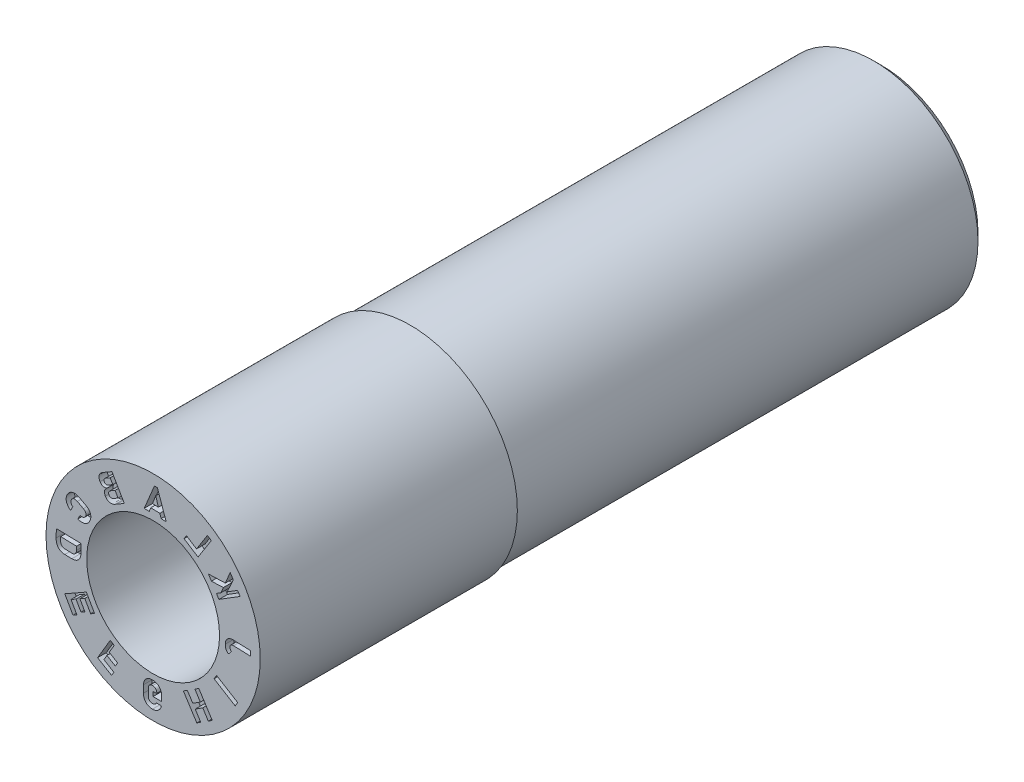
from build123d import *

# Parameters (mm, degrees)
SKETCH4_W          = 11
SKETCH4_H          = 1
CUT_EXTRUDE1_DEPTH = 0.2
CUT_EXTRUDE2_DEPTH = 1.4


with BuildPart() as part:
    # Sketch1 → Revolve1 (revolve)
    with BuildSketch(Plane(origin=(0, 0, 0), x_dir=(0, 0, -1), z_dir=(1, 0, 0)), mode=Mode.PRIVATE) as revolve1_sk:
        Polygon((0, 2.5), (0, 1.55), (2.8, 1.55), (2.8, 0.8), (14, 0.8), (14, 1.5), (17, 1.5), (17, 2.25), (16.75, 2.5), align=None)
    revolve(revolve1_sk.sketch.rotate(Axis((0, 0, 3.797909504), (0, 0, -1)), 90), axis=Axis((0, 0, 3.797909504), (0, 0, -1)))

    # Sketch4 → Cut-Revolve1 (revolve, cut)
    with BuildSketch(Plane(origin=(0, 0, 0), x_dir=(0, 0, -1), z_dir=(1, 0, 0)), mode=Mode.PRIVATE) as cut_revolve1_sk:
        with Locations((11.5, 2.935)):
            Rectangle(SKETCH4_W, SKETCH4_H)
    revolve(cut_revolve1_sk.sketch.rotate(Axis((0, 0, 0), (0, 0, -1)), 90), axis=Axis((0, 0, 0), (0, 0, -1)), mode=Mode.SUBTRACT)

    # Sketch2 → Cut-Extrude1 (cut)
    # profile 1 of 12: a face of its own
    with BuildSketch(Plane.XY):
        Polygon((1.72661267, 0.970958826), (1.870917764, 1.28365961), (1.798222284, 1.400652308), (1.685546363, 1.127555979), (1.291940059, 1.114724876), (1.360540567, 1.004369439), (1.638844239, 1.014362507), (1.584484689, 0.882609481), (1.477586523, 0.816159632), (1.535391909, 0.723134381), (2.028751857, 1.029815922), (1.970946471, 1.122841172), align=None)
    # profile 2 of 12: a face of its own
    with BuildSketch(Plane.XY):
        Polygon((1.158278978, -1.657754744), (1.287748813, -1.860409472), (1.380179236, -1.801341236), (1.067016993, -1.311159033), (0.97458657, -1.370227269), (1.101447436, -1.568798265), (0.925495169, -1.681204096), (0.798646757, -1.482652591), (0.706269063, -1.541615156), (1.019431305, -2.031797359), (1.111808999, -1.972834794), (0.982326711, -1.770160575), align=None)
    # profile 3 of 12: a face of its own
    with BuildSketch(Plane.XY):
        Polygon((1.35845363, 1.824056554), (1.266461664, 1.882404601), (1.01308301, 1.482650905), (0.777887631, 1.631784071), (0.721674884, 1.543017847), (1.048827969, 1.335562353), align=None)
    # profile 4 of 12: a face of its own
    with BuildSketch(Plane.XY):
        Polygon((0.100166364, 2.263137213), (0.030849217, 2.265220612), (-0.207963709, 1.692197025), (-0.090343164, 1.688762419), (-0.055088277, 1.780610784), (0.157240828, 1.774362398), (0.18705009, 1.680539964), (0.304552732, 1.677112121), align=None)
        Polygon((0.059995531, 2.08043474), (0.123465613, 1.880667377), (-0.015117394, 1.884745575), align=None, mode=Mode.SUBTRACT)
    # profile 5 of 12: a face of its own
    with BuildSketch(Plane.XY):
        with BuildLine():
            Line((-2.258824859, 0.258308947), (-2.263441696, 0.066635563))
            add(Edge.make_bspline(
                [(-2.263441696, 0.066635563), (-2.263646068, 0.054963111), (-2.263554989, 0.037720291), (-2.261339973, 0.015282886), (-2.259222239, -0.000629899), (-2.256234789, -0.015881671), (-2.252219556, -0.030426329), (-2.247803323, -0.044416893), (-2.242363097, -0.057683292), (-2.236290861, -0.070305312), (-2.229345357, -0.082120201), (-2.221889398, -0.093304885), (-2.213612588, -0.10367424), (-2.204557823, -0.113253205), (-2.194836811, -0.122111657), (-2.18442689, -0.130251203), (-2.173234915, -0.137521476), (-2.161455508, -0.144123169), (-2.148960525, -0.149863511), (-2.13584036, -0.154657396), (-2.122208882, -0.159015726), (-2.107848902, -0.162054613), (-2.087633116, -0.165517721), (-2.072008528, -0.166722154), (-2.061412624, -0.166919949)],
                knots=[0, 0, 0, 0, 0.099794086, 0.147020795, 0.192531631, 0.236902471, 0.279655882, 0.321378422, 0.362153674, 0.402037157, 0.4409344, 0.479137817, 0.51678508, 0.554126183, 0.59163048, 0.629044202, 0.666880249, 0.705532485, 0.744313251, 0.784196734, 0.824816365, 0.866447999, 0.909454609, 1, 1, 1, 1], degree=3))
            Line((-2.061412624, -0.166919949), (-1.897139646, -0.170910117))
            add(Edge.make_bspline(
                [(-1.897139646, -0.170910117), (-1.887036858, -0.171037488), (-1.872062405, -0.170811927), (-1.852534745, -0.168479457), (-1.838519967, -0.16617852), (-1.825038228, -0.162754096), (-1.811978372, -0.158682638), (-1.799466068, -0.153723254), (-1.787402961, -0.14801727), (-1.775855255, -0.141532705), (-1.764972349, -0.13410769), (-1.754686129, -0.125921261), (-1.745008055, -0.116931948), (-1.735981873, -0.107051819), (-1.72769524, -0.096282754), (-1.719854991, -0.084830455), (-1.71279458, -0.072499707), (-1.706343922, -0.059446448), (-1.700669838, -0.045634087), (-1.696015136, -0.031005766), (-1.691914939, -0.01570972), (-1.688686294, 0.000364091), (-1.685276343, 0.023208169), (-1.684369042, 0.040847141), (-1.683927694, 0.0528024)],
                knots=[0, 0, 0, 0, 0.086499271, 0.127800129, 0.16816221, 0.207901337, 0.246685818, 0.285119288, 0.322935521, 0.36077424, 0.398289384, 0.435513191, 0.473140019, 0.51117007, 0.549849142, 0.589296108, 0.62981103, 0.671288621, 0.713785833, 0.757410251, 0.802522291, 0.849197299, 0.897584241, 1, 1, 1, 1], degree=3))
            Line((-1.683927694, 0.0528024), (-1.679328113, 0.244121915))
            Line((-1.679328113, 0.244121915), (-2.258824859, 0.258308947))
        make_face()
        with BuildLine():
            Line((-1.787242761, 0.137458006), (-1.78929147, 0.052501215))
            add(Edge.make_bspline(
                [(-1.78929147, 0.052501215), (-1.789455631, 0.044018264), (-1.790659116, 0.031686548), (-1.793569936, 0.015835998), (-1.796737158, 0.005081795), (-1.800609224, -0.004924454), (-1.805353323, -0.014117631), (-1.810862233, -0.022538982), (-1.817153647, -0.030150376), (-1.824099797, -0.036964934), (-1.831808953, -0.042768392), (-1.840111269, -0.047729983), (-1.849124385, -0.051690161), (-1.858776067, -0.054594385), (-1.872784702, -0.057552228), (-1.883794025, -0.057984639), (-1.891269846, -0.05780714)],
                knots=[0, 0, 0, 0, 0.148983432, 0.217482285, 0.282935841, 0.345735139, 0.405806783, 0.464430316, 0.522276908, 0.579066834, 0.635058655, 0.691480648, 0.748728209, 0.807608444, 0.868361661, 1, 1, 1, 1], degree=3))
            Line((-1.891269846, -0.05780714), (-2.061918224, -0.053624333))
            add(Edge.make_bspline(
                [(-2.061918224, -0.053624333), (-2.069440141, -0.053626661), (-2.080374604, -0.052265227), (-2.094363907, -0.048992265), (-2.103786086, -0.045384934), (-2.112556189, -0.041052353), (-2.120670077, -0.035782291), (-2.128016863, -0.029486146), (-2.134685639, -0.02238072), (-2.140616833, -0.014508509), (-2.145612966, -0.005766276), (-2.149942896, 0.003627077), (-2.153110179, 0.01385057), (-2.155934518, 0.024669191), (-2.158017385, 0.040654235), (-2.158642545, 0.053039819), (-2.158342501, 0.061510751)],
                knots=[0, 0, 0, 0, 0.131832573, 0.193163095, 0.252020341, 0.308710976, 0.364837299, 0.421574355, 0.478332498, 0.535823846, 0.594354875, 0.655002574, 0.7171934, 0.782202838, 0.851268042, 1, 1, 1, 1], degree=3))
            Line((-2.158342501, 0.061510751), (-2.156293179, 0.146492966))
            Line((-2.156293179, 0.146492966), (-1.787242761, 0.137458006))
        make_face(mode=Mode.SUBTRACT)
    # profile 6 of 12: a face of its own
    with BuildSketch(Plane.XY):
        with BuildLine():
            Line((-1.131150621, 1.959210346), (-1.164860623, 1.939693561))
            add(Edge.make_bspline(
                [(-1.164860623, 1.939693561), (-1.17996664, 1.931076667), (-1.200768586, 1.91653084), (-1.2244042, 1.893829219), (-1.238445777, 1.876293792), (-1.249564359, 1.857985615), (-1.257674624, 1.838974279), (-1.262478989, 1.819266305), (-1.264093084, 1.799044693), (-1.262825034, 1.778384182), (-1.256254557, 1.74976303), (-1.247139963, 1.729097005), (-1.239354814, 1.715873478)],
                knots=[0, 0, 0, 0, 0.19484118, 0.28294724, 0.366427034, 0.445852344, 0.52229235, 0.597128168, 0.672122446, 0.748836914, 0.828156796, 1, 1, 1, 1], degree=3))
            add(Edge.make_bspline(
                [(-1.239354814, 1.715873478), (-1.233893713, 1.706741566), (-1.224978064, 1.693666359), (-1.209942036, 1.679545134), (-1.19819265, 1.670633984), (-1.185384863, 1.663683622), (-1.171974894, 1.658201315), (-1.157706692, 1.65479234), (-1.142830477, 1.653138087), (-1.127399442, 1.653149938), (-1.105637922, 1.655798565), (-1.089448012, 1.660400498), (-1.078713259, 1.664380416)],
                knots=[0, 0, 0, 0, 0.17252886, 0.253082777, 0.332553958, 0.410187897, 0.487931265, 0.566064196, 0.646434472, 0.729377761, 0.814892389, 1, 1, 1, 1], degree=3))
            add(Edge.make_bspline(
                [(-1.078713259, 1.664380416), (-1.088268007, 1.656896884), (-1.101439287, 1.644784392), (-1.115582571, 1.626193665), (-1.123740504, 1.611813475), (-1.130195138, 1.596997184), (-1.134234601, 1.581675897), (-1.136379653, 1.56603961), (-1.136130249, 1.550087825), (-1.133919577, 1.533895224), (-1.127937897, 1.511632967), (-1.120375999, 1.495636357), (-1.114379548, 1.485277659)],
                knots=[0, 0, 0, 0, 0.180279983, 0.263920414, 0.345728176, 0.425166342, 0.503120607, 0.580165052, 0.658736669, 0.739148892, 0.82220143, 1, 1, 1, 1], degree=3))
            Line((-1.114379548, 1.485277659), (-1.113809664, 1.484134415))
            add(Edge.make_bspline(
                [(-1.113809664, 1.484134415), (-1.106035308, 1.47081283), (-1.092815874, 1.452214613), (-1.070819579, 1.432421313), (-1.053496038, 1.42081415), (-1.035025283, 1.412052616), (-1.015381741, 1.406565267), (-0.994777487, 1.403926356), (-0.973234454, 1.404593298), (-0.950998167, 1.408143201), (-0.919502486, 1.417303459), (-0.896648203, 1.428383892), (-0.881606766, 1.437095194)],
                knots=[0, 0, 0, 0, 0.17235677, 0.251845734, 0.328866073, 0.40420085, 0.478853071, 0.555422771, 0.635018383, 0.718404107, 0.805968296, 1, 1, 1, 1], degree=3))
            Line((-0.881606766, 1.437095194), (-0.842709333, 1.459615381))
            Line((-0.842709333, 1.459615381), (-0.67216725, 1.558404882))
            Line((-0.67216725, 1.558404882), (-0.961328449, 2.057582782))
            Line((-0.961328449, 2.057582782), (-1.131150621, 1.959210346))
        make_face()
        with BuildLine():
            Line((-0.81864993, 1.594554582), (-0.925097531, 1.532931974))
            add(Edge.make_bspline(
                [(-0.925097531, 1.532931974), (-0.93473122, 1.527431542), (-0.949513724, 1.520670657), (-0.970054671, 1.517891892), (-0.984009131, 1.519112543), (-0.997075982, 1.523163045), (-1.01321453, 1.53311578), (-1.022377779, 1.544560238), (-1.027214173, 1.553065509)],
                knots=[0, 0, 0, 0, 0.283177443, 0.406051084, 0.522898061, 0.63653052, 0.750637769, 1, 1, 1, 1], degree=3))
            Line((-1.027214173, 1.553065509), (-1.027784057, 1.554208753))
            add(Edge.make_bspline(
                [(-1.027784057, 1.554208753), (-1.031105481, 1.560111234), (-1.035491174, 1.569143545), (-1.038214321, 1.581839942), (-1.038792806, 1.590938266), (-1.03791297, 1.59982694), (-1.035937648, 1.608556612), (-1.032092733, 1.616866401), (-1.027209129, 1.624995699), (-1.020934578, 1.632736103), (-1.010609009, 1.642871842), (-1.001238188, 1.649034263), (-0.994720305, 1.652999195)],
                knots=[0, 0, 0, 0, 0.172443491, 0.251642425, 0.328086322, 0.402714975, 0.477610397, 0.553923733, 0.633837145, 0.717731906, 0.805932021, 1, 1, 1, 1], degree=3))
            Line((-0.994720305, 1.652999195), (-0.888219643, 1.71465252))
            Line((-0.888219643, 1.71465252), (-0.81864993, 1.594554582))
        make_face(mode=Mode.SUBTRACT)
        with BuildLine():
            Line((-0.940791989, 1.805407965), (-1.047225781, 1.743793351))
            add(Edge.make_bspline(
                [(-1.047225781, 1.743793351), (-1.055908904, 1.738700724), (-1.069427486, 1.732786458), (-1.088123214, 1.730513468), (-1.100909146, 1.731835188), (-1.112818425, 1.736090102), (-1.127984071, 1.745415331), (-1.136127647, 1.756749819), (-1.140948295, 1.764561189)],
                knots=[0, 0, 0, 0, 0.277909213, 0.39883638, 0.514792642, 0.628277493, 0.744294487, 1, 1, 1, 1], degree=3))
            add(Edge.make_bspline(
                [(-1.140948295, 1.764561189), (-1.145078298, 1.771831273), (-1.149935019, 1.783605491), (-1.149728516, 1.799953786), (-1.147004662, 1.811545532), (-1.14134906, 1.822564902), (-1.130000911, 1.837310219), (-1.117755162, 1.845534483), (-1.109232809, 1.850785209)],
                knots=[0, 0, 0, 0, 0.243538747, 0.354355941, 0.466789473, 0.583916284, 0.708822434, 1, 1, 1, 1], degree=3))
            Line((-1.109232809, 1.850785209), (-1.002777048, 1.912412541))
            Line((-1.002777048, 1.912412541), (-0.940791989, 1.805407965))
        make_face(mode=Mode.SUBTRACT)
    # profile 7 of 12: a face of its own
    with BuildSketch(Plane.XY):
        with BuildLine():
            Line((-1.575355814, 1.075402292), (-1.715277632, 1.15057052))
            add(Edge.make_bspline(
                [(-1.715277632, 1.15057052), (-1.724947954, 1.155859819), (-1.739618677, 1.162897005), (-1.759522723, 1.170542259), (-1.773921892, 1.175350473), (-1.788183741, 1.178994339), (-1.802234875, 1.181819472), (-1.816131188, 1.183680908), (-1.829849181, 1.184417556), (-1.843279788, 1.184181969), (-1.856420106, 1.183032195), (-1.869280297, 1.180971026), (-1.881796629, 1.177898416), (-1.894081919, 1.173964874), (-1.906029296, 1.16905526), (-1.917620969, 1.163015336), (-1.929020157, 1.156295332), (-1.939950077, 1.14842365), (-1.950565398, 1.139773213), (-1.960634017, 1.130061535), (-1.970366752, 1.119536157), (-1.979729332, 1.10812638), (-1.991672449, 1.091321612), (-1.999744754, 1.077836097), (-2.004829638, 1.068491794)],
                knots=[0, 0, 0, 0, 0.096624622, 0.142398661, 0.186863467, 0.229624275, 0.27135326, 0.312453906, 0.35241742, 0.391669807, 0.430119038, 0.467962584, 0.505732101, 0.542992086, 0.580961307, 0.618804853, 0.657494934, 0.696860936, 0.736763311, 0.777446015, 0.819379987, 0.862386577, 0.906737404, 1, 1, 1, 1], degree=3))
            add(Edge.make_bspline(
                [(-2.004829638, 1.068491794), (-2.0130641, 1.053270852), (-2.022925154, 1.029410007), (-2.02937616, 0.996223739), (-2.030899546, 0.971680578), (-2.029100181, 0.947248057), (-2.024150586, 0.923049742), (-2.015637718, 0.899356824), (-2.004112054, 0.876100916), (-1.989377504, 0.85350598), (-1.965059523, 0.823540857), (-1.942944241, 0.803701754), (-1.927052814, 0.791241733)],
                knots=[0, 0, 0, 0, 0.164201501, 0.242596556, 0.319639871, 0.396683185, 0.474246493, 0.553099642, 0.634724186, 0.719833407, 0.808342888, 1, 1, 1, 1], degree=3))
            Line((-1.927052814, 0.791241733), (-1.873517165, 0.890840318))
            add(Edge.make_bspline(
                [(-1.873517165, 0.890840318), (-1.880560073, 0.89683215), (-1.890262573, 0.906375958), (-1.900990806, 0.920475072), (-1.907415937, 0.931072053), (-1.912548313, 0.941782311), (-1.916268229, 0.952615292), (-1.918698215, 0.963501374), (-1.919601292, 0.974417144), (-1.919259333, 0.985247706), (-1.916566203, 0.999754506), (-1.912488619, 1.010198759), (-1.908858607, 1.016806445)],
                knots=[0, 0, 0, 0, 0.194933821, 0.285549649, 0.372723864, 0.455674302, 0.53535755, 0.613624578, 0.690099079, 0.765613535, 0.841310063, 1, 1, 1, 1], degree=3))
            add(Edge.make_bspline(
                [(-1.908858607, 1.016806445), (-1.904439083, 1.025251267), (-1.896610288, 1.036904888), (-1.883644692, 1.049643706), (-1.873375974, 1.057216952), (-1.862232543, 1.062845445), (-1.850420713, 1.066609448), (-1.837976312, 1.068634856), (-1.824905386, 1.068851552), (-1.811342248, 1.067147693), (-1.79213411, 1.062113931), (-1.778002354, 1.056140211), (-1.768813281, 1.050971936)],
                knots=[0, 0, 0, 0, 0.174570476, 0.254564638, 0.331757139, 0.407200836, 0.48203633, 0.557840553, 0.637209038, 0.72053247, 0.807255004, 1, 1, 1, 1], degree=3))
            Line((-1.768813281, 1.050971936), (-1.628891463, 0.975803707))
            add(Edge.make_bspline(
                [(-1.628891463, 0.975803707), (-1.619667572, 0.970732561), (-1.60666425, 0.962514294), (-1.592030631, 0.949153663), (-1.583306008, 0.938780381), (-1.576344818, 0.927856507), (-1.571129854, 0.916424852), (-1.568028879, 0.904478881), (-1.566664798, 0.892178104), (-1.567050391, 0.879480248), (-1.570816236, 0.86168189), (-1.575913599, 0.848639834), (-1.580588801, 0.840281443)],
                knots=[0, 0, 0, 0, 0.19351187, 0.280630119, 0.362837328, 0.441628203, 0.517789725, 0.592525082, 0.667190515, 0.744400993, 0.82463709, 1, 1, 1, 1], degree=3))
            add(Edge.make_bspline(
                [(-1.580588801, 0.840281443), (-1.584289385, 0.833624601), (-1.590629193, 0.824218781), (-1.601333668, 0.8138451), (-1.610083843, 0.807344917), (-1.619705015, 0.802074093), (-1.629975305, 0.797714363), (-1.641122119, 0.79508377), (-1.652860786, 0.793424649), (-1.66522216, 0.793060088), (-1.68293543, 0.794533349), (-1.696290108, 0.797522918), (-1.705199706, 0.80031563)],
                knots=[0, 0, 0, 0, 0.16010072, 0.235762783, 0.311874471, 0.388093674, 0.465534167, 0.545220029, 0.627617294, 0.714044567, 0.804102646, 1, 1, 1, 1], degree=3))
            Line((-1.705199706, 0.80031563), (-1.758735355, 0.700717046))
            add(Edge.make_bspline(
                [(-1.758735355, 0.700717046), (-1.739518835, 0.694411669), (-1.710703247, 0.687031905), (-1.672276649, 0.683325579), (-1.645321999, 0.683581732), (-1.619639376, 0.686738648), (-1.595254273, 0.692726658), (-1.572348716, 0.701711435), (-1.55102081, 0.71368393), (-1.531389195, 0.728391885), (-1.507078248, 0.751886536), (-1.492802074, 0.773425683), (-1.484454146, 0.788562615)],
                knots=[0, 0, 0, 0, 0.192087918, 0.280831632, 0.365703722, 0.447404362, 0.525862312, 0.603384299, 0.680175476, 0.757265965, 0.835593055, 1, 1, 1, 1], degree=3))
            add(Edge.make_bspline(
                [(-1.484454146, 0.788562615), (-1.479409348, 0.79792844), (-1.472672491, 0.81211688), (-1.465326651, 0.831384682), (-1.460923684, 0.845455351), (-1.457416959, 0.85937195), (-1.455084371, 0.873156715), (-1.453504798, 0.886771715), (-1.453075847, 0.900240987), (-1.453604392, 0.913476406), (-1.455054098, 0.926422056), (-1.457413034, 0.939126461), (-1.460846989, 0.951549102), (-1.465199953, 0.963716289), (-1.470436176, 0.975624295), (-1.476887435, 0.987133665), (-1.484030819, 0.998538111), (-1.49231841, 1.00947491), (-1.501452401, 1.020081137), (-1.511466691, 1.03029316), (-1.522375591, 1.040168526), (-1.534303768, 1.049551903), (-1.551662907, 1.061902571), (-1.565636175, 1.070234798), (-1.575355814, 1.075402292)],
                knots=[0, 0, 0, 0, 0.093275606, 0.137538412, 0.18072332, 0.222498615, 0.263280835, 0.303236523, 0.342603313, 0.381321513, 0.419300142, 0.456741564, 0.494512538, 0.532188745, 0.56998495, 0.608428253, 0.647787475, 0.687903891, 0.728623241, 0.770462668, 0.813246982, 0.857567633, 0.903467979, 1, 1, 1, 1], degree=3))
        make_face()
    # profile 8 of 12: a face of its own
    with BuildSketch(Plane.XY):
        Polygon((-1.916215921, -1.004409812), (-1.799750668, -0.938259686), (-1.683651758, -1.142814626), (-1.59209579, -1.090816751), (-1.708196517, -0.886258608), (-1.595292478, -0.822131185), (-1.457537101, -1.064701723), (-1.365981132, -1.012703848), (-1.557721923, -0.675203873), (-2.061613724, -0.96140517), (-1.869872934, -1.298905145), (-1.778478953, -1.246947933), align=None)
    # profile 9 of 12: a face of its own
    with BuildSketch(Plane.XY):
        Polygon((-1.148673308, -1.836061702), (-1.07780408, -1.71630046), (-0.881770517, -1.832236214), (-0.828147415, -1.741730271), (-1.024229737, -1.625765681), (-0.907035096, -1.427719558), (-1.001053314, -1.37211859), (-1.296330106, -1.871104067), (-0.968668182, -2.064995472), (-0.914998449, -1.974329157), align=None)
    # profile 10 of 12: a face of its own
    with BuildSketch(Plane.XY):
        with BuildLine():
            Line((0.198532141, -2.010507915), (0.199216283, -1.897252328))
            add(Edge.make_bspline(
                [(0.199216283, -1.897252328), (0.199307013, -1.886801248), (0.198701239, -1.87132269), (0.196100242, -1.851111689), (0.193341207, -1.836638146), (0.189761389, -1.822617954), (0.185288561, -1.809096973), (0.18020431, -1.795947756), (0.174078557, -1.78339958), (0.167280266, -1.771408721), (0.159891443, -1.759978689), (0.151601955, -1.749405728), (0.14275923, -1.739443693), (0.133237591, -1.730179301), (0.123122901, -1.721505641), (0.112166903, -1.713677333), (0.10055926, -1.706579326), (0.088445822, -1.700148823), (0.075732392, -1.694671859), (0.06261931, -1.689837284), (0.048945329, -1.686056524), (0.034834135, -1.682992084), (0.0151189, -1.680060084), (-1.5407e-05, -1.679114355), (-0.010229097, -1.679030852)],
                knots=[0, 0, 0, 0, 0.09199654, 0.136095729, 0.179244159, 0.221605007, 0.263350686, 0.304528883, 0.345590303, 0.386117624, 0.425805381, 0.465251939, 0.504243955, 0.542965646, 0.582092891, 0.621405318, 0.661335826, 0.701778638, 0.741996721, 0.783087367, 0.824689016, 0.866749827, 0.910114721, 1, 1, 1, 1], degree=3))
            add(Edge.make_bspline(
                [(-0.010229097, -1.679030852), (-0.020480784, -1.678949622), (-0.035694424, -1.679526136), (-0.055526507, -1.68220469), (-0.069803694, -1.684740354), (-0.083511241, -1.688472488), (-0.096903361, -1.692538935), (-0.10969521, -1.697778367), (-0.122073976, -1.703579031), (-0.133833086, -1.7102062), (-0.145074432, -1.717291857), (-0.155503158, -1.725291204), (-0.165291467, -1.733874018), (-0.174419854, -1.7431029), (-0.182853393, -1.75299347), (-0.190721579, -1.763473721), (-0.197639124, -1.774757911), (-0.203984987, -1.786469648), (-0.209464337, -1.79871864), (-0.214118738, -1.811445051), (-0.217987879, -1.824600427), (-0.220825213, -1.838280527), (-0.223878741, -1.85729323), (-0.224482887, -1.871951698), (-0.224700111, -1.88179416)],
                knots=[0, 0, 0, 0, 0.092559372, 0.137074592, 0.180551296, 0.223301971, 0.265207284, 0.306773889, 0.347925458, 0.388510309, 0.428515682, 0.467745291, 0.506986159, 0.545931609, 0.584778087, 0.624219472, 0.664066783, 0.704109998, 0.744368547, 0.785043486, 0.826329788, 0.867994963, 0.911053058, 1, 1, 1, 1], degree=3))
            Line((-0.224700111, -1.88179416), (-0.225800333, -2.052798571))
            add(Edge.make_bspline(
                [(-0.225800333, -2.052798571), (-0.22591523, -2.063251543), (-0.225263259, -2.078764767), (-0.222698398, -2.099019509), (-0.219926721, -2.113531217), (-0.216342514, -2.127549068), (-0.211903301, -2.141044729), (-0.206752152, -2.154126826), (-0.200702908, -2.166634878), (-0.193819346, -2.178537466), (-0.186517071, -2.189947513), (-0.178143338, -2.200418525), (-0.169335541, -2.210363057), (-0.15985165, -2.219684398), (-0.149548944, -2.228141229), (-0.138641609, -2.23603921), (-0.127036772, -2.243075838), (-0.114978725, -2.249615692), (-0.102247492, -2.254965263), (-0.089170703, -2.259889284), (-0.075522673, -2.263635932), (-0.061451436, -2.266692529), (-0.0417798, -2.269656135), (-0.026679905, -2.270558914), (-0.016468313, -2.270664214)],
                knots=[0, 0, 0, 0, 0.092104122, 0.136597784, 0.179796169, 0.22220606, 0.26400007, 0.304905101, 0.34601406, 0.386289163, 0.42602287, 0.46524453, 0.504281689, 0.54304821, 0.582269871, 0.621627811, 0.661604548, 0.701785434, 0.742370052, 0.783180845, 0.824830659, 0.866940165, 0.910011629, 1, 1, 1, 1], degree=3))
            add(Edge.make_bspline(
                [(-0.016468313, -2.270664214), (0.000262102, -2.27069479), (0.025218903, -2.268467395), (0.057020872, -2.259572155), (0.079511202, -2.25043296), (0.100597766, -2.238773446), (0.120016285, -2.224800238), (0.137634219, -2.208573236), (0.153328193, -2.190225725), (0.166986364, -2.169989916), (0.18200442, -2.140298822), (0.189842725, -2.11633691), (0.193090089, -2.099724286)],
                knots=[0, 0, 0, 0, 0.170739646, 0.253562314, 0.335948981, 0.417755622, 0.498684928, 0.579330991, 0.661412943, 0.744361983, 0.827661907, 1, 1, 1, 1], degree=3))
            Line((0.193090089, -2.099724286), (0.075111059, -2.098977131))
            add(Edge.make_bspline(
                [(0.075111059, -2.098977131), (0.07310506, -2.104929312), (0.069100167, -2.113516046), (0.061781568, -2.123734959), (0.055466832, -2.130801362), (0.048111, -2.136829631), (0.040352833, -2.142415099), (0.031881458, -2.146964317), (0.013874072, -2.15461904), (-0.002580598, -2.157302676), (-0.015666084, -2.157410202)],
                knots=[0, 0, 0, 0, 0.163474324, 0.244456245, 0.326461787, 0.40923783, 0.491403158, 0.574879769, 0.658813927, 1, 1, 1, 1], degree=3))
            add(Edge.make_bspline(
                [(-0.015666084, -2.157410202), (-0.024865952, -2.157360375), (-0.038418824, -2.155807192), (-0.055319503, -2.150177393), (-0.066859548, -2.144636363), (-0.077340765, -2.137473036), (-0.086617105, -2.12891406), (-0.094598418, -2.119014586), (-0.101178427, -2.107841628), (-0.106464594, -2.095605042), (-0.111522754, -2.077527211), (-0.112752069, -2.063193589), (-0.112662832, -2.053481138)],
                knots=[0, 0, 0, 0, 0.172581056, 0.253084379, 0.332959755, 0.411744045, 0.490112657, 0.568710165, 0.649189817, 0.732419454, 0.817859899, 1, 1, 1, 1], degree=3))
            Line((-0.112662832, -2.053481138), (-0.11156261, -1.882476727))
            add(Edge.make_bspline(
                [(-0.11156261, -1.882476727), (-0.111314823, -1.873953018), (-0.110255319, -1.861171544), (-0.104594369, -1.845453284), (-0.099141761, -1.834698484), (-0.092274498, -1.824898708), (-0.083913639, -1.81637455), (-0.074380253, -1.808955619), (-0.063623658, -1.802854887), (-0.05179443, -1.798077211), (-0.034358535, -1.793212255), (-0.02043527, -1.792364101), (-0.011031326, -1.792284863)],
                knots=[0, 0, 0, 0, 0.169044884, 0.249343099, 0.328174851, 0.406361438, 0.484362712, 0.562826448, 0.643931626, 0.727439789, 0.813944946, 1, 1, 1, 1], degree=3))
            add(Edge.make_bspline(
                [(-0.011031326, -1.792284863), (-0.001699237, -1.792315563), (0.011945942, -1.793962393), (0.029181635, -1.799068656), (0.040667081, -1.80464905), (0.051224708, -1.811297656), (0.060305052, -1.819694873), (0.068323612, -1.829236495), (0.074721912, -1.840336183), (0.07994136, -1.852471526), (0.084798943, -1.870703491), (0.086127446, -1.885152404), (0.085981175, -1.895033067)],
                knots=[0, 0, 0, 0, 0.174904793, 0.256504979, 0.336182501, 0.413875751, 0.489777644, 0.567354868, 0.64693298, 0.729305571, 0.81465958, 1, 1, 1, 1], degree=3))
            Line((0.085981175, -1.895033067), (0.085971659, -1.904599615))
            Line((0.085971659, -1.904599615), (-0.001656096, -1.904021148))
            Line((-0.001656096, -1.904021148), (-0.002351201, -2.009245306))
            Line((-0.002351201, -2.009245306), (0.198532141, -2.010507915))
        make_face()
    # profile 11 of 12: a face of its own
    with BuildSketch(Plane.XY):
        Polygon((1.48058793, -0.841049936), (1.421653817, -0.937486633), (1.915626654, -1.239394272), (1.974560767, -1.142957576), align=None)
    # profile 12 of 12: a face of its own
    with BuildSketch(Plane.XY):
        with BuildLine():
            Line((1.757674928, -0.2694443), (1.825940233, -0.182578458))
            add(Edge.make_bspline(
                [(1.825940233, -0.182578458), (1.820175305, -0.177692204), (1.812193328, -0.169603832), (1.803872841, -0.157063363), (1.798719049, -0.147153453), (1.794794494, -0.136782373), (1.79101986, -0.122704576), (1.79028746, -0.111788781), (1.79049912, -0.104577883)],
                knots=[0, 0, 0, 0, 0.255990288, 0.381213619, 0.507992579, 0.633109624, 0.755677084, 1, 1, 1, 1], degree=3))
            add(Edge.make_bspline(
                [(1.79049912, -0.104577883), (1.790963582, -0.095158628), (1.793512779, -0.080922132), (1.804018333, -0.065484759), (1.814227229, -0.056163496), (1.82702522, -0.04917086), (1.848044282, -0.04247936), (1.86543134, -0.041457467), (1.877420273, -0.041978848)],
                knots=[0, 0, 0, 0, 0.235863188, 0.344479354, 0.456801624, 0.57486085, 0.70238931, 1, 1, 1, 1], degree=3))
            Line((1.877420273, -0.041978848), (2.272360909, -0.05653408))
            Line((2.272360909, -0.05653408), (2.276525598, 0.056610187))
            Line((2.276525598, 0.056610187), (1.881113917, 0.071201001))
            add(Edge.make_bspline(
                [(1.881113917, 0.071201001), (1.862456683, 0.071836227), (1.835007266, 0.070694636), (1.800505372, 0.062528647), (1.781093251, 0.055348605), (1.76685669, 0.048143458), (1.756889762, 0.042139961), (1.747581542, 0.035446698), (1.738837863, 0.028151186), (1.730640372, 0.020251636), (1.7230984, 0.011671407), (1.716244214, 0.002412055), (1.709913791, -0.007413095), (1.704255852, -0.017862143), (1.699435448, -0.028980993), (1.695078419, -0.04052656), (1.691622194, -0.052719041), (1.688570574, -0.065396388), (1.685707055, -0.083445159), (1.684527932, -0.097324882), (1.684220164, -0.106735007)],
                knots=[0, 0, 0, 0, 0.185794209, 0.270782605, 0.351460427, 0.390772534, 0.429196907, 0.466960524, 0.504582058, 0.54226455, 0.579973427, 0.617955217, 0.656635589, 0.696035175, 0.735873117, 0.776977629, 0.81855958, 0.861712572, 0.906477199, 1, 1, 1, 1], degree=3))
            add(Edge.make_bspline(
                [(1.684220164, -0.106735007), (1.683484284, -0.123648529), (1.685026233, -0.148661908), (1.69252282, -0.180565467), (1.700895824, -0.202433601), (1.711499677, -0.22262811), (1.72886955, -0.246670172), (1.74547141, -0.261426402), (1.757674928, -0.2694443)],
                knots=[0, 0, 0, 0, 0.271888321, 0.400104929, 0.52516886, 0.647124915, 0.765606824, 1, 1, 1, 1], degree=3))
        make_face()
    extrude(amount=-CUT_EXTRUDE1_DEPTH, mode=Mode.SUBTRACT)

    # Sketch3 → Cut-Extrude2 (cut)
    with BuildSketch(Plane.XY.offset(-2.8)):
        Polygon((0.461880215, 0.8), (-0.461880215, 0.8), (-0.923760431, 0), (-0.461880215, -0.8), (0.461880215, -0.8), (0.923760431, 0), align=None)
    extrude(amount=-CUT_EXTRUDE2_DEPTH, mode=Mode.SUBTRACT)


solid = part.part
